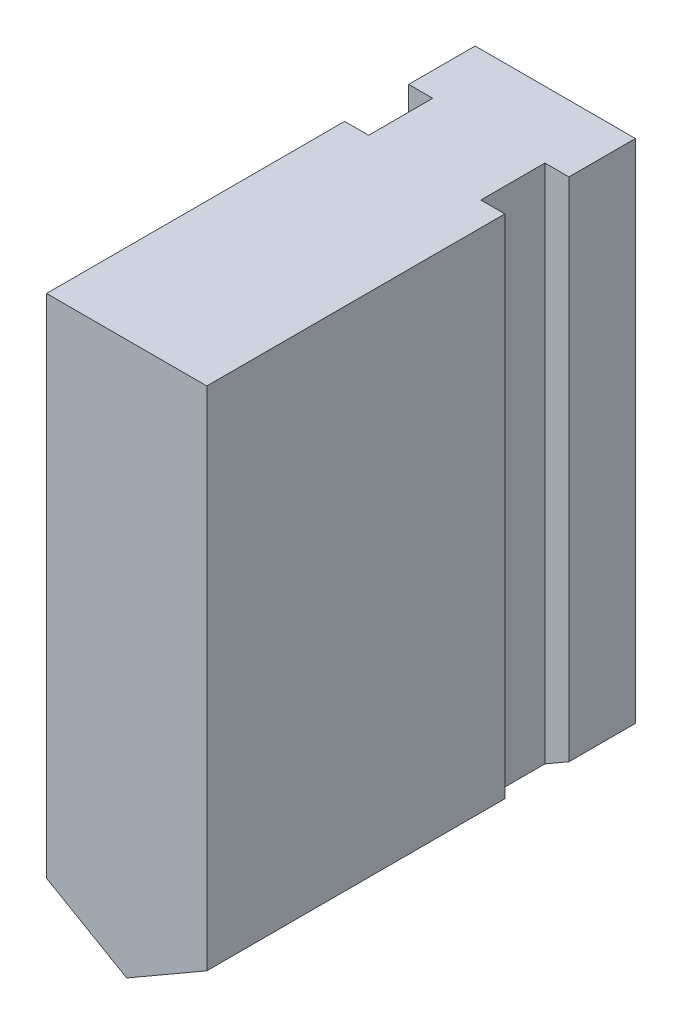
ISO-10303-21;
HEADER;
FILE_DESCRIPTION(('STEP AP214'),'2;1');
FILE_NAME('part.step','',(''),(''),'','','');
FILE_SCHEMA(('AUTOMOTIVE_DESIGN { 1 0 10303 214 1 1 1 1 }'));
ENDSEC;
DATA;
#1=APPLICATION_CONTEXT('core data for automotive mechanical design processes');
#2=APPLICATION_PROTOCOL_DEFINITION('international standard','automotive_design',2000,#1);
#3=PRODUCT_CONTEXT('',#1,'mechanical');
#4=PRODUCT('Part','Part','',(#3));
#5=PRODUCT_RELATED_PRODUCT_CATEGORY('part','',(#4));
#6=PRODUCT_DEFINITION_FORMATION('','',#4);
#7=PRODUCT_DEFINITION_CONTEXT('part definition',#1,'design');
#8=PRODUCT_DEFINITION('design','',#6,#7);
#9=PRODUCT_DEFINITION_SHAPE('','',#8);
#10=(LENGTH_UNIT() NAMED_UNIT(*) SI_UNIT(.MILLI.,.METRE.));
#11=(NAMED_UNIT(*) PLANE_ANGLE_UNIT() SI_UNIT($,.RADIAN.));
#12=(NAMED_UNIT(*) SI_UNIT($,.STERADIAN.) SOLID_ANGLE_UNIT());
#13=UNCERTAINTY_MEASURE_WITH_UNIT(LENGTH_MEASURE(1.E-05),#10,'distance_accuracy_value','');
#14=(GEOMETRIC_REPRESENTATION_CONTEXT(3) GLOBAL_UNCERTAINTY_ASSIGNED_CONTEXT((#13)) GLOBAL_UNIT_ASSIGNED_CONTEXT((#10,
#11,#12)) REPRESENTATION_CONTEXT('',''));
#15=CARTESIAN_POINT('',(0.,0.,0.));
#16=DIRECTION('',(0.,0.,1.));
#17=DIRECTION('',(1.,0.,0.));
#18=AXIS2_PLACEMENT_3D('',#15,#16,#17);
#19=CARTESIAN_POINT('',(-10.,69.,32.5));
#20=DIRECTION('',(0.,-1.,0.));
#21=DIRECTION('',(0.,0.,-1.));
#22=AXIS2_PLACEMENT_3D('',#19,#20,#21);
#23=PLANE('',#22);
#24=DIRECTION('',(1.,0.,0.));
#25=VECTOR('',#24,1.);
#26=CARTESIAN_POINT('',(-17.,69.,-4.7));
#27=LINE('',#26,#25);
#28=CARTESIAN_POINT('',(-10.,69.,-4.7));
#29=VERTEX_POINT('',#28);
#30=CARTESIAN_POINT('',(-7.,69.,-4.7));
#31=VERTEX_POINT('',#30);
#32=EDGE_CURVE('E123',#29,#31,#27,.T.);
#33=ORIENTED_EDGE('',*,*,#32,.F.);
#34=DIRECTION('',(0.,0.,-1.));
#35=VECTOR('',#34,1.);
#36=CARTESIAN_POINT('',(-10.,69.,32.5));
#37=LINE('',#36,#35);
#38=CARTESIAN_POINT('',(-10.,69.,32.5));
#39=VERTEX_POINT('',#38);
#40=EDGE_CURVE('E204',#39,#29,#37,.T.);
#41=ORIENTED_EDGE('',*,*,#40,.F.);
#42=DIRECTION('',(-1.,0.,0.));
#43=VECTOR('',#42,1.);
#44=CARTESIAN_POINT('',(-10.,69.,32.5));
#45=LINE('',#44,#43);
#46=CARTESIAN_POINT('',(10.,69.,32.5));
#47=VERTEX_POINT('',#46);
#48=EDGE_CURVE('E185',#47,#39,#45,.T.);
#49=ORIENTED_EDGE('',*,*,#48,.F.);
#50=DIRECTION('',(0.,0.,-1.));
#51=VECTOR('',#50,1.);
#52=CARTESIAN_POINT('',(10.,69.,32.5));
#53=LINE('',#52,#51);
#54=CARTESIAN_POINT('',(10.,69.,-4.7));
#55=VERTEX_POINT('',#54);
#56=EDGE_CURVE('E207',#47,#55,#53,.T.);
#57=ORIENTED_EDGE('',*,*,#56,.T.);
#58=DIRECTION('',(1.,0.,0.));
#59=VECTOR('',#58,1.);
#60=CARTESIAN_POINT('',(17.,69.,-4.7));
#61=LINE('',#60,#59);
#62=CARTESIAN_POINT('',(7.,69.,-4.7));
#63=VERTEX_POINT('',#62);
#64=EDGE_CURVE('E156',#63,#55,#61,.T.);
#65=ORIENTED_EDGE('',*,*,#64,.F.);
#66=DIRECTION('',(0.,0.,1.));
#67=VECTOR('',#66,1.);
#68=CARTESIAN_POINT('',(7.,69.,-12.7));
#69=LINE('',#68,#67);
#70=CARTESIAN_POINT('',(7.,69.,-12.7));
#71=VERTEX_POINT('',#70);
#72=EDGE_CURVE('E154',#71,#63,#69,.T.);
#73=ORIENTED_EDGE('',*,*,#72,.F.);
#74=DIRECTION('',(-1.,0.,0.));
#75=VECTOR('',#74,1.);
#76=CARTESIAN_POINT('',(17.,69.,-12.7));
#77=LINE('',#76,#75);
#78=CARTESIAN_POINT('',(10.,69.,-12.7));
#79=VERTEX_POINT('',#78);
#80=EDGE_CURVE('E152',#79,#71,#77,.T.);
#81=ORIENTED_EDGE('',*,*,#80,.F.);
#82=CARTESIAN_POINT('',(10.,69.,-21.));
#83=VERTEX_POINT('',#82);
#84=EDGE_CURVE('E206',#79,#83,#53,.T.);
#85=ORIENTED_EDGE('',*,*,#84,.T.);
#86=DIRECTION('',(-1.,0.,0.));
#87=VECTOR('',#86,1.);
#88=CARTESIAN_POINT('',(-10.,69.,-21.));
#89=LINE('',#88,#87);
#90=CARTESIAN_POINT('',(-10.,69.,-21.));
#91=VERTEX_POINT('',#90);
#92=EDGE_CURVE('E170',#83,#91,#89,.T.);
#93=ORIENTED_EDGE('',*,*,#92,.T.);
#94=CARTESIAN_POINT('',(-10.,69.,-12.7));
#95=VERTEX_POINT('',#94);
#96=EDGE_CURVE('E203',#95,#91,#37,.T.);
#97=ORIENTED_EDGE('',*,*,#96,.F.);
#98=DIRECTION('',(-1.,0.,0.));
#99=VECTOR('',#98,1.);
#100=CARTESIAN_POINT('',(-17.,69.,-12.7));
#101=LINE('',#100,#99);
#102=CARTESIAN_POINT('',(-7.,69.,-12.7));
#103=VERTEX_POINT('',#102);
#104=EDGE_CURVE('E145',#103,#95,#101,.T.);
#105=ORIENTED_EDGE('',*,*,#104,.F.);
#106=DIRECTION('',(0.,0.,-1.));
#107=VECTOR('',#106,1.);
#108=CARTESIAN_POINT('',(-7.,69.,-12.7));
#109=LINE('',#108,#107);
#110=EDGE_CURVE('E134',#31,#103,#109,.T.);
#111=ORIENTED_EDGE('',*,*,#110,.F.);
#112=EDGE_LOOP('',(#33,#41,#49,#57,#65,#73,#81,#85,#93,#97,#105,#111));
#113=FACE_BOUND('',#112,.T.);
#114=ADVANCED_FACE('F29',(#113),#23,.F.);
#115=CARTESIAN_POINT('',(-10.,5.77350269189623,32.5));
#116=DIRECTION('',(1.,0.,0.));
#117=DIRECTION('',(0.,0.,-1.));
#118=AXIS2_PLACEMENT_3D('',#115,#116,#117);
#119=PLANE('',#118);
#120=DIRECTION('',(0.,1.,0.));
#121=VECTOR('',#120,1.);
#122=CARTESIAN_POINT('',(-10.,5.77350269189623,-4.7));
#123=LINE('',#122,#121);
#124=CARTESIAN_POINT('',(-10.,5.77350269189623,-4.7));
#125=VERTEX_POINT('',#124);
#126=EDGE_CURVE('E129',#125,#29,#123,.T.);
#127=ORIENTED_EDGE('',*,*,#126,.F.);
#128=DIRECTION('',(0.,0.,-1.));
#129=VECTOR('',#128,1.);
#130=CARTESIAN_POINT('',(-10.,5.77350269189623,32.5));
#131=LINE('',#130,#129);
#132=CARTESIAN_POINT('',(-10.,5.77350269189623,32.5));
#133=VERTEX_POINT('',#132);
#134=EDGE_CURVE('E200',#133,#125,#131,.T.);
#135=ORIENTED_EDGE('',*,*,#134,.F.);
#136=DIRECTION('',(0.,-1.,0.));
#137=VECTOR('',#136,1.);
#138=CARTESIAN_POINT('',(-10.,5.77350269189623,32.5));
#139=LINE('',#138,#137);
#140=EDGE_CURVE('E187',#39,#133,#139,.T.);
#141=ORIENTED_EDGE('',*,*,#140,.F.);
#142=ORIENTED_EDGE('',*,*,#40,.T.);
#143=EDGE_LOOP('',(#127,#135,#141,#142));
#144=FACE_BOUND('',#143,.T.);
#145=ADVANCED_FACE('F224',(#144),#119,.F.);
#146=DIRECTION('',(0.,-1.,0.));
#147=VECTOR('',#146,1.);
#148=CARTESIAN_POINT('',(-10.,5.77350269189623,-12.7));
#149=LINE('',#148,#147);
#150=CARTESIAN_POINT('',(-10.,5.77350269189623,-12.7));
#151=VERTEX_POINT('',#150);
#152=EDGE_CURVE('E44',#95,#151,#149,.T.);
#153=ORIENTED_EDGE('',*,*,#152,.F.);
#154=ORIENTED_EDGE('',*,*,#96,.T.);
#155=DIRECTION('',(0.,-1.,0.));
#156=VECTOR('',#155,1.);
#157=CARTESIAN_POINT('',(-10.,5.77350269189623,-21.));
#158=LINE('',#157,#156);
#159=CARTESIAN_POINT('',(-10.,5.77350269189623,-21.));
#160=VERTEX_POINT('',#159);
#161=EDGE_CURVE('E173',#91,#160,#158,.T.);
#162=ORIENTED_EDGE('',*,*,#161,.T.);
#163=EDGE_CURVE('E199',#151,#160,#131,.T.);
#164=ORIENTED_EDGE('',*,*,#163,.F.);
#165=EDGE_LOOP('',(#153,#154,#162,#164));
#166=FACE_BOUND('',#165,.T.);
#167=ADVANCED_FACE('F260',(#166),#119,.F.);
#168=CARTESIAN_POINT('',(0.,0.,32.5));
#169=DIRECTION('',(0.499999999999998,0.86602540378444,0.));
#170=DIRECTION('',(-0.86602540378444,0.499999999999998,0.));
#171=AXIS2_PLACEMENT_3D('',#168,#169,#170);
#172=PLANE('',#171);
#173=DIRECTION('',(-0.86602540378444,0.499999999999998,0.));
#174=VECTOR('',#173,1.);
#175=CARTESIAN_POINT('',(0.,0.,-4.7));
#176=LINE('',#175,#174);
#177=CARTESIAN_POINT('',(-7.,4.04145188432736,-4.7));
#178=VERTEX_POINT('',#177);
#179=EDGE_CURVE('E11',#178,#125,#176,.T.);
#180=ORIENTED_EDGE('',*,*,#179,.F.);
#181=DIRECTION('',(0.,0.,1.));
#182=VECTOR('',#181,1.);
#183=CARTESIAN_POINT('',(-7.,4.04145188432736,32.5));
#184=LINE('',#183,#182);
#185=CARTESIAN_POINT('',(-7.00000000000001,4.04145188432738,-12.7));
#186=VERTEX_POINT('',#185);
#187=EDGE_CURVE('E37',#186,#178,#184,.T.);
#188=ORIENTED_EDGE('',*,*,#187,.F.);
#189=DIRECTION('',(0.86602540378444,-0.499999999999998,0.));
#190=VECTOR('',#189,1.);
#191=CARTESIAN_POINT('',(0.,0.,-12.7));
#192=LINE('',#191,#190);
#193=EDGE_CURVE('E216',#151,#186,#192,.T.);
#194=ORIENTED_EDGE('',*,*,#193,.F.);
#195=ORIENTED_EDGE('',*,*,#163,.T.);
#196=DIRECTION('',(0.86602540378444,-0.499999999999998,0.));
#197=VECTOR('',#196,1.);
#198=CARTESIAN_POINT('',(0.,0.,-21.));
#199=LINE('',#198,#197);
#200=CARTESIAN_POINT('',(0.,0.,-21.));
#201=VERTEX_POINT('',#200);
#202=EDGE_CURVE('E176',#160,#201,#199,.T.);
#203=ORIENTED_EDGE('',*,*,#202,.T.);
#204=DIRECTION('',(0.,0.,-1.));
#205=VECTOR('',#204,1.);
#206=CARTESIAN_POINT('',(0.,0.,32.5));
#207=LINE('',#206,#205);
#208=CARTESIAN_POINT('',(0.,0.,32.5));
#209=VERTEX_POINT('',#208);
#210=EDGE_CURVE('E197',#209,#201,#207,.T.);
#211=ORIENTED_EDGE('',*,*,#210,.F.);
#212=DIRECTION('',(0.86602540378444,-0.499999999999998,0.));
#213=VECTOR('',#212,1.);
#214=CARTESIAN_POINT('',(0.,0.,32.5));
#215=LINE('',#214,#213);
#216=EDGE_CURVE('E189',#133,#209,#215,.T.);
#217=ORIENTED_EDGE('',*,*,#216,.F.);
#218=ORIENTED_EDGE('',*,*,#134,.T.);
#219=EDGE_LOOP('',(#180,#188,#194,#195,#203,#211,#217,#218));
#220=FACE_BOUND('',#219,.T.);
#221=ADVANCED_FACE('F220',(#220),#172,.F.);
#222=CARTESIAN_POINT('',(10.,5.77350269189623,32.5));
#223=DIRECTION('',(-1.,0.,0.));
#224=DIRECTION('',(0.,0.,1.));
#225=AXIS2_PLACEMENT_3D('',#222,#223,#224);
#226=PLANE('',#225);
#227=DIRECTION('',(0.,1.,0.));
#228=VECTOR('',#227,1.);
#229=CARTESIAN_POINT('',(10.,5.77350269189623,-12.7));
#230=LINE('',#229,#228);
#231=CARTESIAN_POINT('',(10.,5.77350269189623,-12.7));
#232=VERTEX_POINT('',#231);
#233=EDGE_CURVE('E165',#232,#79,#230,.T.);
#234=ORIENTED_EDGE('',*,*,#233,.F.);
#235=DIRECTION('',(0.,0.,-1.));
#236=VECTOR('',#235,1.);
#237=CARTESIAN_POINT('',(10.,5.77350269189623,32.5));
#238=LINE('',#237,#236);
#239=CARTESIAN_POINT('',(10.,5.77350269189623,-21.));
#240=VERTEX_POINT('',#239);
#241=EDGE_CURVE('E193',#232,#240,#238,.T.);
#242=ORIENTED_EDGE('',*,*,#241,.T.);
#243=DIRECTION('',(0.,1.,0.));
#244=VECTOR('',#243,1.);
#245=CARTESIAN_POINT('',(10.,5.77350269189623,-21.));
#246=LINE('',#245,#244);
#247=EDGE_CURVE('E167',#240,#83,#246,.T.);
#248=ORIENTED_EDGE('',*,*,#247,.T.);
#249=ORIENTED_EDGE('',*,*,#84,.F.);
#250=EDGE_LOOP('',(#234,#242,#248,#249));
#251=FACE_BOUND('',#250,.T.);
#252=ADVANCED_FACE('F31',(#251),#226,.F.);
#253=DIRECTION('',(0.,-1.,0.));
#254=VECTOR('',#253,1.);
#255=CARTESIAN_POINT('',(10.,5.77350269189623,-4.7));
#256=LINE('',#255,#254);
#257=CARTESIAN_POINT('',(10.,5.77350269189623,-4.7));
#258=VERTEX_POINT('',#257);
#259=EDGE_CURVE('E52',#55,#258,#256,.T.);
#260=ORIENTED_EDGE('',*,*,#259,.F.);
#261=ORIENTED_EDGE('',*,*,#56,.F.);
#262=DIRECTION('',(0.,1.,0.));
#263=VECTOR('',#262,1.);
#264=CARTESIAN_POINT('',(10.,5.77350269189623,32.5));
#265=LINE('',#264,#263);
#266=CARTESIAN_POINT('',(10.,5.77350269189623,32.5));
#267=VERTEX_POINT('',#266);
#268=EDGE_CURVE('E182',#267,#47,#265,.T.);
#269=ORIENTED_EDGE('',*,*,#268,.F.);
#270=EDGE_CURVE('E194',#267,#258,#238,.T.);
#271=ORIENTED_EDGE('',*,*,#270,.T.);
#272=EDGE_LOOP('',(#260,#261,#269,#271));
#273=FACE_BOUND('',#272,.T.);
#274=ADVANCED_FACE('F234',(#273),#226,.F.);
#275=CARTESIAN_POINT('',(0.,0.,32.5));
#276=DIRECTION('',(-0.499999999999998,0.86602540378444,0.));
#277=DIRECTION('',(-0.86602540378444,-0.499999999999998,0.));
#278=AXIS2_PLACEMENT_3D('',#275,#276,#277);
#279=PLANE('',#278);
#280=DIRECTION('',(0.86602540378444,0.499999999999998,0.));
#281=VECTOR('',#280,1.);
#282=CARTESIAN_POINT('',(0.,0.,-12.7));
#283=LINE('',#282,#281);
#284=CARTESIAN_POINT('',(7.,4.04145188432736,-12.7));
#285=VERTEX_POINT('',#284);
#286=EDGE_CURVE('E214',#285,#232,#283,.T.);
#287=ORIENTED_EDGE('',*,*,#286,.F.);
#288=DIRECTION('',(0.,0.,-1.));
#289=VECTOR('',#288,1.);
#290=CARTESIAN_POINT('',(7.,4.04145188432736,32.5));
#291=LINE('',#290,#289);
#292=CARTESIAN_POINT('',(7.00000000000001,4.04145188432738,-4.7));
#293=VERTEX_POINT('',#292);
#294=EDGE_CURVE('E212',#293,#285,#291,.T.);
#295=ORIENTED_EDGE('',*,*,#294,.F.);
#296=DIRECTION('',(-0.86602540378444,-0.499999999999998,0.));
#297=VECTOR('',#296,1.);
#298=CARTESIAN_POINT('',(0.,0.,-4.7));
#299=LINE('',#298,#297);
#300=EDGE_CURVE('E210',#258,#293,#299,.T.);
#301=ORIENTED_EDGE('',*,*,#300,.F.);
#302=ORIENTED_EDGE('',*,*,#270,.F.);
#303=DIRECTION('',(0.86602540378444,0.499999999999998,0.));
#304=VECTOR('',#303,1.);
#305=CARTESIAN_POINT('',(0.,0.,32.5));
#306=LINE('',#305,#304);
#307=EDGE_CURVE('E191',#209,#267,#306,.T.);
#308=ORIENTED_EDGE('',*,*,#307,.F.);
#309=ORIENTED_EDGE('',*,*,#210,.T.);
#310=DIRECTION('',(0.86602540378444,0.499999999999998,0.));
#311=VECTOR('',#310,1.);
#312=CARTESIAN_POINT('',(0.,0.,-21.));
#313=LINE('',#312,#311);
#314=EDGE_CURVE('E179',#201,#240,#313,.T.);
#315=ORIENTED_EDGE('',*,*,#314,.T.);
#316=ORIENTED_EDGE('',*,*,#241,.F.);
#317=EDGE_LOOP('',(#287,#295,#301,#302,#308,#309,#315,#316));
#318=FACE_BOUND('',#317,.T.);
#319=ADVANCED_FACE('F237',(#318),#279,.F.);
#320=CARTESIAN_POINT('',(10.,69.,32.5));
#321=DIRECTION('',(0.,0.,-1.));
#322=DIRECTION('',(-1.,0.,0.));
#323=AXIS2_PLACEMENT_3D('',#320,#321,#322);
#324=PLANE('',#323);
#325=ORIENTED_EDGE('',*,*,#268,.T.);
#326=ORIENTED_EDGE('',*,*,#48,.T.);
#327=ORIENTED_EDGE('',*,*,#140,.T.);
#328=ORIENTED_EDGE('',*,*,#216,.T.);
#329=ORIENTED_EDGE('',*,*,#307,.T.);
#330=EDGE_LOOP('',(#325,#326,#327,#328,#329));
#331=FACE_BOUND('',#330,.T.);
#332=ADVANCED_FACE('F230',(#331),#324,.F.);
#333=CARTESIAN_POINT('',(10.,69.,-21.));
#334=DIRECTION('',(0.,0.,-1.));
#335=DIRECTION('',(-1.,0.,0.));
#336=AXIS2_PLACEMENT_3D('',#333,#334,#335);
#337=PLANE('',#336);
#338=ORIENTED_EDGE('',*,*,#247,.F.);
#339=ORIENTED_EDGE('',*,*,#314,.F.);
#340=ORIENTED_EDGE('',*,*,#202,.F.);
#341=ORIENTED_EDGE('',*,*,#161,.F.);
#342=ORIENTED_EDGE('',*,*,#92,.F.);
#343=EDGE_LOOP('',(#338,#339,#340,#341,#342));
#344=FACE_BOUND('',#343,.T.);
#345=ADVANCED_FACE('F255',(#344),#337,.T.);
#346=CARTESIAN_POINT('',(17.,69.,-12.7));
#347=DIRECTION('',(0.,0.,1.));
#348=DIRECTION('',(1.,0.,0.));
#349=AXIS2_PLACEMENT_3D('',#346,#347,#348);
#350=PLANE('',#349);
#351=ORIENTED_EDGE('',*,*,#233,.T.);
#352=ORIENTED_EDGE('',*,*,#80,.T.);
#353=DIRECTION('',(0.,-1.,0.));
#354=VECTOR('',#353,1.);
#355=CARTESIAN_POINT('',(7.,69.,-12.7));
#356=LINE('',#355,#354);
#357=EDGE_CURVE('E161',#71,#285,#356,.T.);
#358=ORIENTED_EDGE('',*,*,#357,.T.);
#359=ORIENTED_EDGE('',*,*,#286,.T.);
#360=EDGE_LOOP('',(#351,#352,#358,#359));
#361=FACE_BOUND('',#360,.T.);
#362=ADVANCED_FACE('F324',(#361),#350,.T.);
#363=CARTESIAN_POINT('',(7.,69.,-12.7));
#364=DIRECTION('',(1.,0.,0.));
#365=DIRECTION('',(0.,0.,-1.));
#366=AXIS2_PLACEMENT_3D('',#363,#364,#365);
#367=PLANE('',#366);
#368=ORIENTED_EDGE('',*,*,#294,.T.);
#369=ORIENTED_EDGE('',*,*,#357,.F.);
#370=ORIENTED_EDGE('',*,*,#72,.T.);
#371=DIRECTION('',(0.,-1.,0.));
#372=VECTOR('',#371,1.);
#373=CARTESIAN_POINT('',(7.,69.,-4.7));
#374=LINE('',#373,#372);
#375=EDGE_CURVE('E158',#63,#293,#374,.T.);
#376=ORIENTED_EDGE('',*,*,#375,.T.);
#377=EDGE_LOOP('',(#368,#369,#370,#376));
#378=FACE_BOUND('',#377,.T.);
#379=ADVANCED_FACE('F242',(#378),#367,.T.);
#380=CARTESIAN_POINT('',(17.,69.,-4.7));
#381=DIRECTION('',(0.,0.,-1.));
#382=DIRECTION('',(-1.,0.,0.));
#383=AXIS2_PLACEMENT_3D('',#380,#381,#382);
#384=PLANE('',#383);
#385=ORIENTED_EDGE('',*,*,#259,.T.);
#386=ORIENTED_EDGE('',*,*,#300,.T.);
#387=ORIENTED_EDGE('',*,*,#375,.F.);
#388=ORIENTED_EDGE('',*,*,#64,.T.);
#389=EDGE_LOOP('',(#385,#386,#387,#388));
#390=FACE_BOUND('',#389,.T.);
#391=ADVANCED_FACE('F240',(#390),#384,.T.);
#392=CARTESIAN_POINT('',(-17.,69.,-4.7));
#393=DIRECTION('',(0.,0.,-1.));
#394=DIRECTION('',(-1.,0.,0.));
#395=AXIS2_PLACEMENT_3D('',#392,#393,#394);
#396=PLANE('',#395);
#397=ORIENTED_EDGE('',*,*,#126,.T.);
#398=ORIENTED_EDGE('',*,*,#32,.T.);
#399=DIRECTION('',(0.,-1.,0.));
#400=VECTOR('',#399,1.);
#401=CARTESIAN_POINT('',(-7.,69.,-4.7));
#402=LINE('',#401,#400);
#403=EDGE_CURVE('E126',#31,#178,#402,.T.);
#404=ORIENTED_EDGE('',*,*,#403,.T.);
#405=ORIENTED_EDGE('',*,*,#179,.T.);
#406=EDGE_LOOP('',(#397,#398,#404,#405));
#407=FACE_BOUND('',#406,.T.);
#408=ADVANCED_FACE('F125',(#407),#396,.T.);
#409=CARTESIAN_POINT('',(-7.,69.,-12.7));
#410=DIRECTION('',(-1.,0.,0.));
#411=DIRECTION('',(0.,0.,1.));
#412=AXIS2_PLACEMENT_3D('',#409,#410,#411);
#413=PLANE('',#412);
#414=ORIENTED_EDGE('',*,*,#187,.T.);
#415=ORIENTED_EDGE('',*,*,#403,.F.);
#416=ORIENTED_EDGE('',*,*,#110,.T.);
#417=DIRECTION('',(0.,-1.,0.));
#418=VECTOR('',#417,1.);
#419=CARTESIAN_POINT('',(-7.,69.,-12.7));
#420=LINE('',#419,#418);
#421=EDGE_CURVE('E141',#103,#186,#420,.T.);
#422=ORIENTED_EDGE('',*,*,#421,.T.);
#423=EDGE_LOOP('',(#414,#415,#416,#422));
#424=FACE_BOUND('',#423,.T.);
#425=ADVANCED_FACE('F137',(#424),#413,.T.);
#426=CARTESIAN_POINT('',(-17.,69.,-12.7));
#427=DIRECTION('',(0.,0.,1.));
#428=DIRECTION('',(1.,0.,0.));
#429=AXIS2_PLACEMENT_3D('',#426,#427,#428);
#430=PLANE('',#429);
#431=ORIENTED_EDGE('',*,*,#152,.T.);
#432=ORIENTED_EDGE('',*,*,#193,.T.);
#433=ORIENTED_EDGE('',*,*,#421,.F.);
#434=ORIENTED_EDGE('',*,*,#104,.T.);
#435=EDGE_LOOP('',(#431,#432,#433,#434));
#436=FACE_BOUND('',#435,.T.);
#437=ADVANCED_FACE('F217',(#436),#430,.T.);
#438=CLOSED_SHELL('',(#114,#145,#167,#221,#252,#274,#319,#332,#345,#362,#379,#391,#408,#425,#437));
#439=MANIFOLD_SOLID_BREP('B2',#438);
#440=ADVANCED_BREP_SHAPE_REPRESENTATION('',(#18,#439),#14);
#441=SHAPE_DEFINITION_REPRESENTATION(#9,#440);
ENDSEC;
END-ISO-10303-21;
